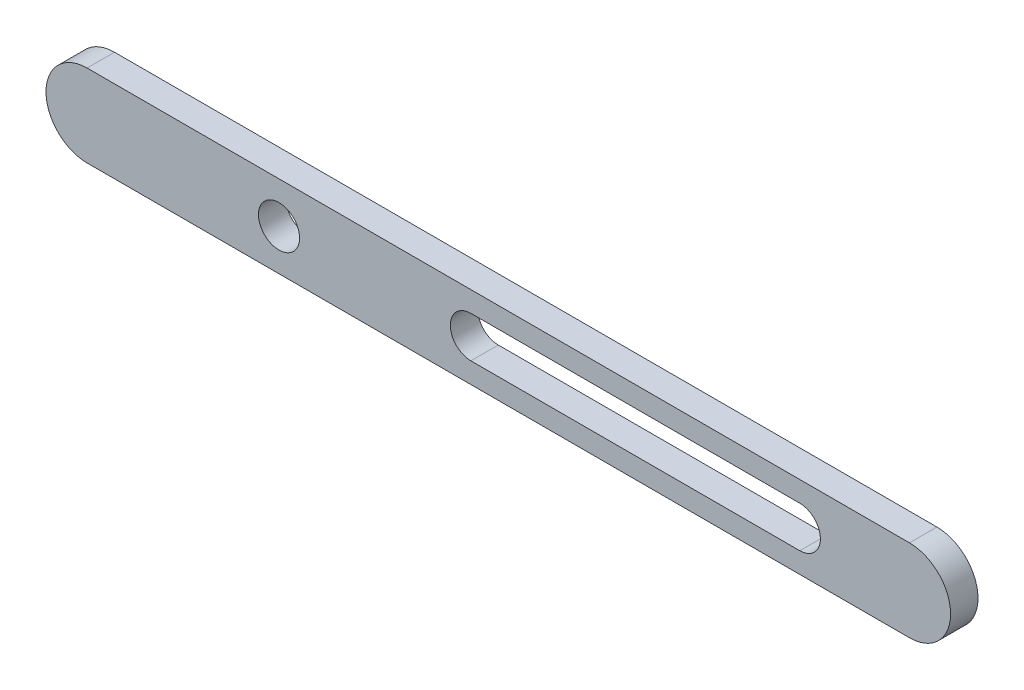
from build123d import *

# Parameters (mm, degrees)
SKETCH1_R      = 7.5
EXTRUDE1_DEPTH = 10


with BuildPart() as part:
    # Sketch1 → Extrude1 (new body)
    with BuildSketch(Plane.XY):
        with BuildLine():
            Line((-70, 15), (230, 15))
            ThreePointArc((230, 15), (245, 0), (230, -15))
            Line((230, -15), (-70, -15))
            ThreePointArc((-70, -15), (-85, 0), (-70, 15))
        make_face()
        Circle(SKETCH1_R, mode=Mode.SUBTRACT)
        with BuildLine():
            Line((70, -7.5), (190, -7.5))
            ThreePointArc((190, -7.5), (197.5, 0), (190, 7.5))
            Line((190, 7.5), (70, 7.5))
            ThreePointArc((70, 7.5), (62.5, 0), (70, -7.5))
        make_face(mode=Mode.SUBTRACT)
    extrude(amount=-EXTRUDE1_DEPTH)


solid = part.part
